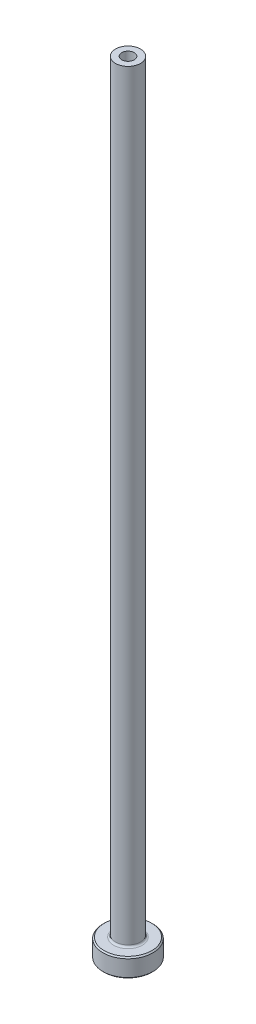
ISO-10303-21;
HEADER;
FILE_DESCRIPTION(('STEP AP214'),'2;1');
FILE_NAME('part.step','',(''),(''),'','','');
FILE_SCHEMA(('AUTOMOTIVE_DESIGN { 1 0 10303 214 1 1 1 1 }'));
ENDSEC;
DATA;
#1=APPLICATION_CONTEXT('core data for automotive mechanical design processes');
#2=APPLICATION_PROTOCOL_DEFINITION('international standard','automotive_design',2000,#1);
#3=PRODUCT_CONTEXT('',#1,'mechanical');
#4=PRODUCT('Part','Part','',(#3));
#5=PRODUCT_RELATED_PRODUCT_CATEGORY('part','',(#4));
#6=PRODUCT_DEFINITION_FORMATION('','',#4);
#7=PRODUCT_DEFINITION_CONTEXT('part definition',#1,'design');
#8=PRODUCT_DEFINITION('design','',#6,#7);
#9=PRODUCT_DEFINITION_SHAPE('','',#8);
#10=(LENGTH_UNIT() NAMED_UNIT(*) SI_UNIT(.MILLI.,.METRE.));
#11=(NAMED_UNIT(*) PLANE_ANGLE_UNIT() SI_UNIT($,.RADIAN.));
#12=(NAMED_UNIT(*) SI_UNIT($,.STERADIAN.) SOLID_ANGLE_UNIT());
#13=UNCERTAINTY_MEASURE_WITH_UNIT(LENGTH_MEASURE(1.E-05),#10,'distance_accuracy_value','');
#14=(GEOMETRIC_REPRESENTATION_CONTEXT(3) GLOBAL_UNCERTAINTY_ASSIGNED_CONTEXT((#13)) GLOBAL_UNIT_ASSIGNED_CONTEXT((#10,
#11,#12)) REPRESENTATION_CONTEXT('',''));
#15=CARTESIAN_POINT('',(0.,0.,0.));
#16=DIRECTION('',(0.,0.,1.));
#17=DIRECTION('',(1.,0.,0.));
#18=AXIS2_PLACEMENT_3D('',#15,#16,#17);
#19=CARTESIAN_POINT('',(0.,92.1876809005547,0.));
#20=DIRECTION('',(0.,1.,0.));
#21=DIRECTION('',(0.,0.,1.));
#22=AXIS2_PLACEMENT_3D('',#19,#20,#21);
#23=CYLINDRICAL_SURFACE('',#22,0.999999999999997);
#24=CARTESIAN_POINT('',(0.,125.,0.));
#25=DIRECTION('',(0.,1.,0.));
#26=DIRECTION('',(0.,0.,1.));
#27=AXIS2_PLACEMENT_3D('',#24,#25,#26);
#28=CIRCLE('',#27,0.999999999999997);
#29=CARTESIAN_POINT('',(0.,125.,0.999999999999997));
#30=VERTEX_POINT('',#29);
#31=EDGE_CURVE('E62',#30,#30,#28,.T.);
#32=ORIENTED_EDGE('',*,*,#31,.T.);
#33=EDGE_LOOP('',(#32));
#34=FACE_BOUND('',#33,.T.);
#35=CARTESIAN_POINT('',(0.,90.,0.));
#36=DIRECTION('',(0.,1.,0.));
#37=DIRECTION('',(0.,0.,1.));
#38=AXIS2_PLACEMENT_3D('',#35,#36,#37);
#39=CIRCLE('',#38,0.999999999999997);
#40=CARTESIAN_POINT('',(0.,90.,0.999999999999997));
#41=VERTEX_POINT('',#40);
#42=EDGE_CURVE('E71',#41,#41,#39,.T.);
#43=ORIENTED_EDGE('',*,*,#42,.F.);
#44=EDGE_LOOP('',(#43));
#45=FACE_BOUND('',#44,.T.);
#46=ADVANCED_FACE('F30',(#34,#45),#23,.F.);
#47=CARTESIAN_POINT('',(-0.999999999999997,125.,0.));
#48=DIRECTION('',(0.,1.,0.));
#49=DIRECTION('',(0.,0.,1.));
#50=AXIS2_PLACEMENT_3D('',#47,#48,#49);
#51=PLANE('',#50);
#52=CARTESIAN_POINT('',(0.,125.,0.));
#53=DIRECTION('',(0.,1.,0.));
#54=DIRECTION('',(0.,0.,1.));
#55=AXIS2_PLACEMENT_3D('',#52,#53,#54);
#56=CIRCLE('',#55,2.);
#57=CARTESIAN_POINT('',(0.,125.,2.));
#58=VERTEX_POINT('',#57);
#59=EDGE_CURVE('E65',#58,#58,#56,.T.);
#60=ORIENTED_EDGE('',*,*,#59,.T.);
#61=EDGE_LOOP('',(#60));
#62=FACE_BOUND('',#61,.T.);
#63=ORIENTED_EDGE('',*,*,#31,.F.);
#64=EDGE_LOOP('',(#63));
#65=FACE_BOUND('',#64,.T.);
#66=ADVANCED_FACE('F79',(#62,#65),#51,.T.);
#67=CARTESIAN_POINT('',(0.,92.1876809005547,0.));
#68=DIRECTION('',(0.,1.,0.));
#69=DIRECTION('',(0.,0.,1.));
#70=AXIS2_PLACEMENT_3D('',#67,#68,#69);
#71=CYLINDRICAL_SURFACE('',#70,2.);
#72=CARTESIAN_POINT('',(0.,3.3,0.));
#73=DIRECTION('',(0.,1.,0.));
#74=DIRECTION('',(0.,0.,1.));
#75=AXIS2_PLACEMENT_3D('',#72,#73,#74);
#76=CIRCLE('',#75,2.);
#77=CARTESIAN_POINT('',(0.,3.3,2.));
#78=VERTEX_POINT('',#77);
#79=EDGE_CURVE('E59',#78,#78,#76,.T.);
#80=ORIENTED_EDGE('',*,*,#79,.T.);
#81=EDGE_LOOP('',(#80));
#82=FACE_BOUND('',#81,.T.);
#83=ORIENTED_EDGE('',*,*,#59,.F.);
#84=EDGE_LOOP('',(#83));
#85=FACE_BOUND('',#84,.T.);
#86=ADVANCED_FACE('F85',(#82,#85),#71,.T.);
#87=CARTESIAN_POINT('',(-1.99999999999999,3.,0.));
#88=DIRECTION('',(0.,1.,0.));
#89=DIRECTION('',(0.,0.,1.));
#90=AXIS2_PLACEMENT_3D('',#87,#88,#89);
#91=PLANE('',#90);
#92=CARTESIAN_POINT('',(0.,3.,0.));
#93=DIRECTION('',(0.,1.,0.));
#94=DIRECTION('',(0.,0.,1.));
#95=AXIS2_PLACEMENT_3D('',#92,#93,#94);
#96=CIRCLE('',#95,3.79999999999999);
#97=CARTESIAN_POINT('',(0.,3.,3.79999999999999));
#98=VERTEX_POINT('',#97);
#99=EDGE_CURVE('E53',#98,#98,#96,.T.);
#100=ORIENTED_EDGE('',*,*,#99,.T.);
#101=EDGE_LOOP('',(#100));
#102=FACE_BOUND('',#101,.T.);
#103=CARTESIAN_POINT('',(0.,3.,0.));
#104=DIRECTION('',(0.,1.,0.));
#105=DIRECTION('',(0.,0.,1.));
#106=AXIS2_PLACEMENT_3D('',#103,#104,#105);
#107=CIRCLE('',#106,2.3);
#108=CARTESIAN_POINT('',(0.,3.,2.3));
#109=VERTEX_POINT('',#108);
#110=EDGE_CURVE('E56',#109,#109,#107,.F.);
#111=ORIENTED_EDGE('',*,*,#110,.T.);
#112=EDGE_LOOP('',(#111));
#113=FACE_BOUND('',#112,.T.);
#114=ADVANCED_FACE('F111',(#102,#113),#91,.T.);
#115=CARTESIAN_POINT('',(0.,92.1876809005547,0.));
#116=DIRECTION('',(0.,1.,0.));
#117=DIRECTION('',(0.,0.,1.));
#118=AXIS2_PLACEMENT_3D('',#115,#116,#117);
#119=CYLINDRICAL_SURFACE('',#118,3.99999999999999);
#120=CARTESIAN_POINT('',(0.,2.8,0.));
#121=DIRECTION('',(0.,1.,0.));
#122=DIRECTION('',(0.,0.,1.));
#123=AXIS2_PLACEMENT_3D('',#120,#121,#122);
#124=CIRCLE('',#123,3.99999999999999);
#125=CARTESIAN_POINT('',(0.,2.8,3.99999999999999));
#126=VERTEX_POINT('',#125);
#127=EDGE_CURVE('E45',#126,#126,#124,.F.);
#128=ORIENTED_EDGE('',*,*,#127,.T.);
#129=EDGE_LOOP('',(#128));
#130=FACE_BOUND('',#129,.T.);
#131=CARTESIAN_POINT('',(0.,0.200000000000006,0.));
#132=DIRECTION('',(0.,-1.,0.));
#133=DIRECTION('',(0.,0.,-1.));
#134=AXIS2_PLACEMENT_3D('',#131,#132,#133);
#135=CIRCLE('',#134,3.99999999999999);
#136=CARTESIAN_POINT('',(0.,0.200000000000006,-3.99999999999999));
#137=VERTEX_POINT('',#136);
#138=EDGE_CURVE('E50',#137,#137,#135,.F.);
#139=ORIENTED_EDGE('',*,*,#138,.T.);
#140=EDGE_LOOP('',(#139));
#141=FACE_BOUND('',#140,.T.);
#142=ADVANCED_FACE('F108',(#130,#141),#119,.T.);
#143=CARTESIAN_POINT('',(-3.99999999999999,0.,0.));
#144=DIRECTION('',(0.,-1.,0.));
#145=DIRECTION('',(0.,0.,-1.));
#146=AXIS2_PLACEMENT_3D('',#143,#144,#145);
#147=PLANE('',#146);
#148=CARTESIAN_POINT('',(0.,0.,0.));
#149=DIRECTION('',(0.,-1.,0.));
#150=DIRECTION('',(0.,0.,-1.));
#151=AXIS2_PLACEMENT_3D('',#148,#149,#150);
#152=CIRCLE('',#151,1.74999999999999);
#153=CARTESIAN_POINT('',(0.,0.,-1.74999999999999));
#154=VERTEX_POINT('',#153);
#155=EDGE_CURVE('E37',#154,#154,#152,.F.);
#156=ORIENTED_EDGE('',*,*,#155,.T.);
#157=EDGE_LOOP('',(#156));
#158=FACE_BOUND('',#157,.T.);
#159=CARTESIAN_POINT('',(0.,0.,0.));
#160=DIRECTION('',(0.,-1.,0.));
#161=DIRECTION('',(0.,0.,-1.));
#162=AXIS2_PLACEMENT_3D('',#159,#160,#161);
#163=CIRCLE('',#162,3.79999999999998);
#164=CARTESIAN_POINT('',(0.,0.,-3.79999999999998));
#165=VERTEX_POINT('',#164);
#166=EDGE_CURVE('E41',#165,#165,#163,.T.);
#167=ORIENTED_EDGE('',*,*,#166,.T.);
#168=EDGE_LOOP('',(#167));
#169=FACE_BOUND('',#168,.T.);
#170=ADVANCED_FACE('F110',(#158,#169),#147,.T.);
#171=CARTESIAN_POINT('',(0.,92.1876809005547,0.));
#172=DIRECTION('',(0.,1.,0.));
#173=DIRECTION('',(0.,0.,1.));
#174=AXIS2_PLACEMENT_3D('',#171,#172,#173);
#175=CYLINDRICAL_SURFACE('',#174,1.25);
#176=CARTESIAN_POINT('',(0.,0.499999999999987,0.));
#177=DIRECTION('',(0.,-1.,0.));
#178=DIRECTION('',(0.,0.,-1.));
#179=AXIS2_PLACEMENT_3D('',#176,#177,#178);
#180=CIRCLE('',#179,1.25);
#181=CARTESIAN_POINT('',(0.,0.499999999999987,-1.25));
#182=VERTEX_POINT('',#181);
#183=EDGE_CURVE('E10',#182,#182,#180,.T.);
#184=ORIENTED_EDGE('',*,*,#183,.T.);
#185=EDGE_LOOP('',(#184));
#186=FACE_BOUND('',#185,.T.);
#187=CARTESIAN_POINT('',(0.,78.,0.));
#188=DIRECTION('',(0.,1.,0.));
#189=DIRECTION('',(0.,0.,1.));
#190=AXIS2_PLACEMENT_3D('',#187,#188,#189);
#191=CIRCLE('',#190,1.25);
#192=CARTESIAN_POINT('',(0.,78.,1.25));
#193=VERTEX_POINT('',#192);
#194=EDGE_CURVE('E68',#193,#193,#191,.T.);
#195=ORIENTED_EDGE('',*,*,#194,.T.);
#196=EDGE_LOOP('',(#195));
#197=FACE_BOUND('',#196,.T.);
#198=ADVANCED_FACE('F118',(#186,#197),#175,.F.);
#199=CARTESIAN_POINT('',(0.,78.,0.));
#200=DIRECTION('',(0.,-1.,0.));
#201=DIRECTION('',(0.,0.,-1.));
#202=AXIS2_PLACEMENT_3D('',#199,#200,#201);
#203=CONICAL_SURFACE('',#202,1.25,0.0208303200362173);
#204=ORIENTED_EDGE('',*,*,#42,.T.);
#205=EDGE_LOOP('',(#204));
#206=FACE_BOUND('',#205,.T.);
#207=ORIENTED_EDGE('',*,*,#194,.F.);
#208=EDGE_LOOP('',(#207));
#209=FACE_BOUND('',#208,.T.);
#210=ADVANCED_FACE('F75',(#206,#209),#203,.F.);
#211=CARTESIAN_POINT('',(0.,3.3,0.));
#212=DIRECTION('',(0.,1.,0.));
#213=DIRECTION('',(0.,0.,1.));
#214=AXIS2_PLACEMENT_3D('',#211,#212,#213);
#215=TOROIDAL_SURFACE('',#214,2.3,0.3);
#216=ORIENTED_EDGE('',*,*,#110,.F.);
#217=EDGE_LOOP('',(#216));
#218=FACE_BOUND('',#217,.T.);
#219=ORIENTED_EDGE('',*,*,#79,.F.);
#220=EDGE_LOOP('',(#219));
#221=FACE_BOUND('',#220,.T.);
#222=ADVANCED_FACE('F90',(#218,#221),#215,.F.);
#223=CARTESIAN_POINT('',(0.,3.,0.));
#224=DIRECTION('',(0.,-1.,0.));
#225=DIRECTION('',(0.,0.,-1.));
#226=AXIS2_PLACEMENT_3D('',#223,#224,#225);
#227=CONICAL_SURFACE('',#226,3.79999999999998,0.785398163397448);
#228=ORIENTED_EDGE('',*,*,#127,.F.);
#229=EDGE_LOOP('',(#228));
#230=FACE_BOUND('',#229,.T.);
#231=ORIENTED_EDGE('',*,*,#99,.F.);
#232=EDGE_LOOP('',(#231));
#233=FACE_BOUND('',#232,.T.);
#234=ADVANCED_FACE('F93',(#230,#233),#227,.T.);
#235=CARTESIAN_POINT('',(0.,0.200000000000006,0.));
#236=DIRECTION('',(0.,1.,0.));
#237=DIRECTION('',(0.,0.,1.));
#238=AXIS2_PLACEMENT_3D('',#235,#236,#237);
#239=CONICAL_SURFACE('',#238,3.99999999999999,0.785398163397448);
#240=ORIENTED_EDGE('',*,*,#166,.F.);
#241=EDGE_LOOP('',(#240));
#242=FACE_BOUND('',#241,.T.);
#243=ORIENTED_EDGE('',*,*,#138,.F.);
#244=EDGE_LOOP('',(#243));
#245=FACE_BOUND('',#244,.T.);
#246=ADVANCED_FACE('F96',(#242,#245),#239,.T.);
#247=CARTESIAN_POINT('',(0.,0.,0.));
#248=DIRECTION('',(0.,-1.,0.));
#249=DIRECTION('',(0.,0.,-1.));
#250=AXIS2_PLACEMENT_3D('',#247,#248,#249);
#251=CONICAL_SURFACE('',#250,1.74999999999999,0.785398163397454);
#252=ORIENTED_EDGE('',*,*,#183,.F.);
#253=EDGE_LOOP('',(#252));
#254=FACE_BOUND('',#253,.T.);
#255=ORIENTED_EDGE('',*,*,#155,.F.);
#256=EDGE_LOOP('',(#255));
#257=FACE_BOUND('',#256,.T.);
#258=ADVANCED_FACE('F32',(#254,#257),#251,.F.);
#259=CLOSED_SHELL('',(#46,#66,#86,#114,#142,#170,#198,#210,#222,#234,#246,#258));
#260=MANIFOLD_SOLID_BREP('B2',#259);
#261=ADVANCED_BREP_SHAPE_REPRESENTATION('',(#18,#260),#14);
#262=SHAPE_DEFINITION_REPRESENTATION(#9,#261);
ENDSEC;
END-ISO-10303-21;
